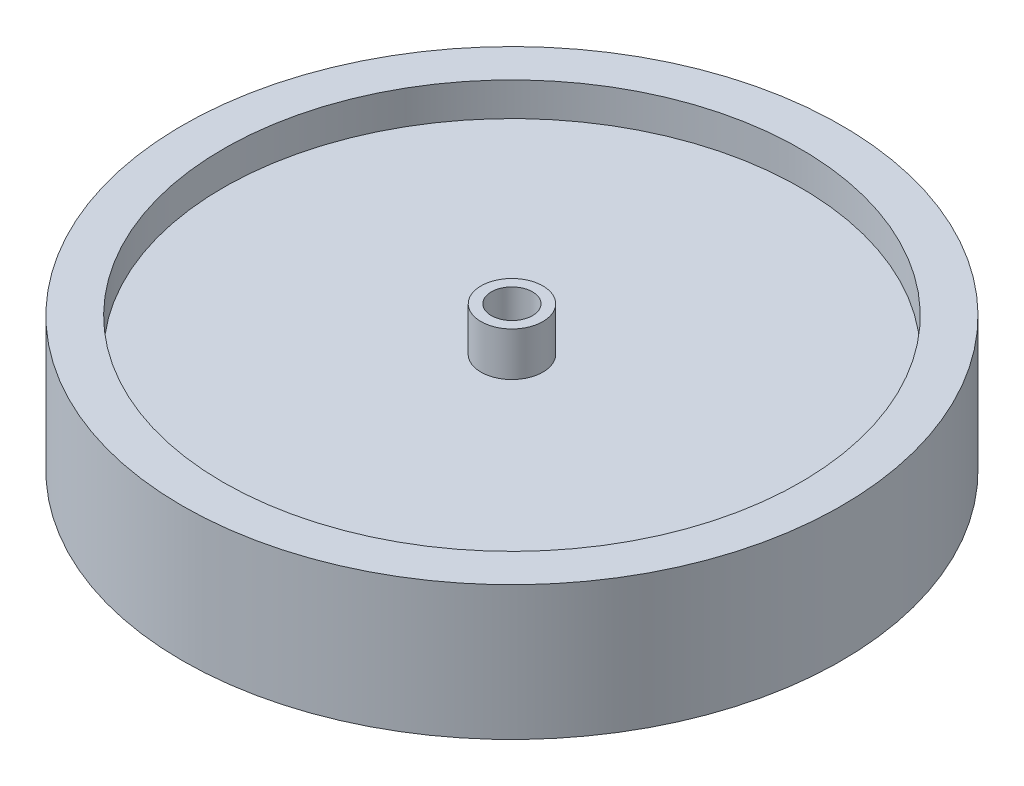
ISO-10303-21;
HEADER;
FILE_DESCRIPTION(('STEP AP214'),'2;1');
FILE_NAME('part.step','',(''),(''),'','','');
FILE_SCHEMA(('AUTOMOTIVE_DESIGN { 1 0 10303 214 1 1 1 1 }'));
ENDSEC;
DATA;
#1=APPLICATION_CONTEXT('core data for automotive mechanical design processes');
#2=APPLICATION_PROTOCOL_DEFINITION('international standard','automotive_design',2000,#1);
#3=PRODUCT_CONTEXT('',#1,'mechanical');
#4=PRODUCT('Part','Part','',(#3));
#5=PRODUCT_RELATED_PRODUCT_CATEGORY('part','',(#4));
#6=PRODUCT_DEFINITION_FORMATION('','',#4);
#7=PRODUCT_DEFINITION_CONTEXT('part definition',#1,'design');
#8=PRODUCT_DEFINITION('design','',#6,#7);
#9=PRODUCT_DEFINITION_SHAPE('','',#8);
#10=(LENGTH_UNIT() NAMED_UNIT(*) SI_UNIT(.MILLI.,.METRE.));
#11=(NAMED_UNIT(*) PLANE_ANGLE_UNIT() SI_UNIT($,.RADIAN.));
#12=(NAMED_UNIT(*) SI_UNIT($,.STERADIAN.) SOLID_ANGLE_UNIT());
#13=UNCERTAINTY_MEASURE_WITH_UNIT(LENGTH_MEASURE(1.E-05),#10,'distance_accuracy_value','');
#14=(GEOMETRIC_REPRESENTATION_CONTEXT(3) GLOBAL_UNCERTAINTY_ASSIGNED_CONTEXT((#13)) GLOBAL_UNIT_ASSIGNED_CONTEXT((#10,
#11,#12)) REPRESENTATION_CONTEXT('',''));
#15=CARTESIAN_POINT('',(0.,0.,0.));
#16=DIRECTION('',(0.,0.,1.));
#17=DIRECTION('',(1.,0.,0.));
#18=AXIS2_PLACEMENT_3D('',#15,#16,#17);
#19=CARTESIAN_POINT('',(4.76250000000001,-6.51115316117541,0.));
#20=DIRECTION('',(0.,-1.,0.));
#21=DIRECTION('',(0.,0.,-1.));
#22=AXIS2_PLACEMENT_3D('',#19,#20,#21);
#23=PLANE('',#22);
#24=CARTESIAN_POINT('',(0.,-6.51115316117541,0.));
#25=DIRECTION('',(0.,1.,0.));
#26=DIRECTION('',(0.,0.,1.));
#27=AXIS2_PLACEMENT_3D('',#24,#25,#26);
#28=CIRCLE('',#27,44.45);
#29=CARTESIAN_POINT('',(0.,-6.51115316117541,44.45));
#30=VERTEX_POINT('',#29);
#31=EDGE_CURVE('E51',#30,#30,#28,.T.);
#32=ORIENTED_EDGE('',*,*,#31,.F.);
#33=EDGE_LOOP('',(#32));
#34=FACE_BOUND('',#33,.T.);
#35=CARTESIAN_POINT('',(0.,-6.5111531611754,0.));
#36=DIRECTION('',(0.,1.,0.));
#37=DIRECTION('',(0.,0.,1.));
#38=AXIS2_PLACEMENT_3D('',#35,#36,#37);
#39=CIRCLE('',#38,50.7365);
#40=CARTESIAN_POINT('',(0.,-6.5111531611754,50.7365));
#41=VERTEX_POINT('',#40);
#42=EDGE_CURVE('E35',#41,#41,#39,.T.);
#43=ORIENTED_EDGE('',*,*,#42,.T.);
#44=EDGE_LOOP('',(#43));
#45=FACE_BOUND('',#44,.T.);
#46=ADVANCED_FACE('F28',(#34,#45),#23,.F.);
#47=CARTESIAN_POINT('',(0.,28.7361531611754,0.));
#48=DIRECTION('',(0.,1.,0.));
#49=DIRECTION('',(0.,0.,1.));
#50=AXIS2_PLACEMENT_3D('',#47,#48,#49);
#51=CYLINDRICAL_SURFACE('',#50,50.7365);
#52=ORIENTED_EDGE('',*,*,#42,.F.);
#53=EDGE_LOOP('',(#52));
#54=FACE_BOUND('',#53,.T.);
#55=CARTESIAN_POINT('',(0.,-27.1486531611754,0.));
#56=DIRECTION('',(0.,1.,0.));
#57=DIRECTION('',(0.,0.,1.));
#58=AXIS2_PLACEMENT_3D('',#55,#56,#57);
#59=CIRCLE('',#58,50.7365);
#60=CARTESIAN_POINT('',(0.,-27.1486531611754,50.7365));
#61=VERTEX_POINT('',#60);
#62=EDGE_CURVE('E39',#61,#61,#59,.T.);
#63=ORIENTED_EDGE('',*,*,#62,.T.);
#64=EDGE_LOOP('',(#63));
#65=FACE_BOUND('',#64,.T.);
#66=ADVANCED_FACE('F104',(#54,#65),#51,.T.);
#67=CARTESIAN_POINT('',(50.7365,-27.1486531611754,0.));
#68=DIRECTION('',(0.,1.,0.));
#69=DIRECTION('',(0.,0.,1.));
#70=AXIS2_PLACEMENT_3D('',#67,#68,#69);
#71=PLANE('',#70);
#72=CARTESIAN_POINT('',(0.,-27.1486531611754,0.));
#73=DIRECTION('',(0.,-1.,0.));
#74=DIRECTION('',(0.,0.,-1.));
#75=AXIS2_PLACEMENT_3D('',#72,#73,#74);
#76=CIRCLE('',#75,44.45);
#77=CARTESIAN_POINT('',(0.,-27.1486531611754,-44.45));
#78=VERTEX_POINT('',#77);
#79=EDGE_CURVE('E60',#78,#78,#76,.T.);
#80=ORIENTED_EDGE('',*,*,#79,.F.);
#81=EDGE_LOOP('',(#80));
#82=FACE_BOUND('',#81,.T.);
#83=ORIENTED_EDGE('',*,*,#62,.F.);
#84=EDGE_LOOP('',(#83));
#85=FACE_BOUND('',#84,.T.);
#86=ADVANCED_FACE('F100',(#82,#85),#71,.F.);
#87=CARTESIAN_POINT('',(0.,-11.6673531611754,0.));
#88=DIRECTION('',(0.,1.,0.));
#89=DIRECTION('',(0.,0.,1.));
#90=AXIS2_PLACEMENT_3D('',#87,#88,#89);
#91=CYLINDRICAL_SURFACE('',#90,44.45);
#92=CARTESIAN_POINT('',(0.,-11.6673531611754,0.));
#93=DIRECTION('',(0.,1.,0.));
#94=DIRECTION('',(0.,0.,1.));
#95=AXIS2_PLACEMENT_3D('',#92,#93,#94);
#96=CIRCLE('',#95,44.45);
#97=CARTESIAN_POINT('',(0.,-11.6673531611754,44.45));
#98=VERTEX_POINT('',#97);
#99=EDGE_CURVE('E48',#98,#98,#96,.T.);
#100=ORIENTED_EDGE('',*,*,#99,.F.);
#101=EDGE_LOOP('',(#100));
#102=FACE_BOUND('',#101,.T.);
#103=ORIENTED_EDGE('',*,*,#31,.T.);
#104=EDGE_LOOP('',(#103));
#105=FACE_BOUND('',#104,.T.);
#106=ADVANCED_FACE('F103',(#102,#105),#91,.F.);
#107=CARTESIAN_POINT('',(0.,-11.6673531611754,0.));
#108=DIRECTION('',(0.,1.,0.));
#109=DIRECTION('',(0.,0.,1.));
#110=AXIS2_PLACEMENT_3D('',#107,#108,#109);
#111=PLANE('',#110);
#112=CARTESIAN_POINT('',(0.,-11.6673531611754,0.));
#113=DIRECTION('',(0.,1.,0.));
#114=DIRECTION('',(0.,0.,1.));
#115=AXIS2_PLACEMENT_3D('',#112,#113,#114);
#116=CIRCLE('',#115,4.7625);
#117=CARTESIAN_POINT('',(0.,-11.6673531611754,4.7625));
#118=VERTEX_POINT('',#117);
#119=EDGE_CURVE('E54',#118,#118,#116,.T.);
#120=ORIENTED_EDGE('',*,*,#119,.F.);
#121=EDGE_LOOP('',(#120));
#122=FACE_BOUND('',#121,.T.);
#123=ORIENTED_EDGE('',*,*,#99,.T.);
#124=EDGE_LOOP('',(#123));
#125=FACE_BOUND('',#124,.T.);
#126=ADVANCED_FACE('F121',(#122,#125),#111,.T.);
#127=CARTESIAN_POINT('',(0.,-4.92365316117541,0.));
#128=DIRECTION('',(0.,-1.,0.));
#129=DIRECTION('',(0.,0.,-1.));
#130=AXIS2_PLACEMENT_3D('',#127,#128,#129);
#131=PLANE('',#130);
#132=CARTESIAN_POINT('',(0.,-4.92365316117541,0.));
#133=DIRECTION('',(0.,-1.,0.));
#134=DIRECTION('',(0.,0.,-1.));
#135=AXIS2_PLACEMENT_3D('',#132,#133,#134);
#136=CIRCLE('',#135,3.175);
#137=CARTESIAN_POINT('',(0.,-4.92365316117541,-3.175));
#138=VERTEX_POINT('',#137);
#139=EDGE_CURVE('E66',#138,#138,#136,.T.);
#140=ORIENTED_EDGE('',*,*,#139,.T.);
#141=EDGE_LOOP('',(#140));
#142=FACE_BOUND('',#141,.T.);
#143=CARTESIAN_POINT('',(0.,-4.92365316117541,0.));
#144=DIRECTION('',(0.,1.,0.));
#145=DIRECTION('',(0.,0.,1.));
#146=AXIS2_PLACEMENT_3D('',#143,#144,#145);
#147=CIRCLE('',#146,4.7625);
#148=CARTESIAN_POINT('',(0.,-4.92365316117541,4.7625));
#149=VERTEX_POINT('',#148);
#150=EDGE_CURVE('E10',#149,#149,#147,.T.);
#151=ORIENTED_EDGE('',*,*,#150,.T.);
#152=EDGE_LOOP('',(#151));
#153=FACE_BOUND('',#152,.T.);
#154=ADVANCED_FACE('F30',(#142,#153),#131,.F.);
#155=CARTESIAN_POINT('',(0.,28.7361531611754,0.));
#156=DIRECTION('',(0.,1.,0.));
#157=DIRECTION('',(0.,0.,1.));
#158=AXIS2_PLACEMENT_3D('',#155,#156,#157);
#159=CYLINDRICAL_SURFACE('',#158,4.7625);
#160=ORIENTED_EDGE('',*,*,#150,.F.);
#161=EDGE_LOOP('',(#160));
#162=FACE_BOUND('',#161,.T.);
#163=ORIENTED_EDGE('',*,*,#119,.T.);
#164=EDGE_LOOP('',(#163));
#165=FACE_BOUND('',#164,.T.);
#166=ADVANCED_FACE('F96',(#162,#165),#159,.T.);
#167=CARTESIAN_POINT('',(0.,-21.9924531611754,0.));
#168=DIRECTION('',(0.,-1.,0.));
#169=DIRECTION('',(0.,0.,-1.));
#170=AXIS2_PLACEMENT_3D('',#167,#168,#169);
#171=CYLINDRICAL_SURFACE('',#170,44.45);
#172=CARTESIAN_POINT('',(0.,-21.9924531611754,0.));
#173=DIRECTION('',(0.,-1.,0.));
#174=DIRECTION('',(0.,0.,-1.));
#175=AXIS2_PLACEMENT_3D('',#172,#173,#174);
#176=CIRCLE('',#175,44.45);
#177=CARTESIAN_POINT('',(0.,-21.9924531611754,-44.45));
#178=VERTEX_POINT('',#177);
#179=EDGE_CURVE('E57',#178,#178,#176,.T.);
#180=ORIENTED_EDGE('',*,*,#179,.F.);
#181=EDGE_LOOP('',(#180));
#182=FACE_BOUND('',#181,.T.);
#183=ORIENTED_EDGE('',*,*,#79,.T.);
#184=EDGE_LOOP('',(#183));
#185=FACE_BOUND('',#184,.T.);
#186=ADVANCED_FACE('F90',(#182,#185),#171,.F.);
#187=CARTESIAN_POINT('',(0.,-21.9924531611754,0.));
#188=DIRECTION('',(0.,-1.,0.));
#189=DIRECTION('',(0.,0.,-1.));
#190=AXIS2_PLACEMENT_3D('',#187,#188,#189);
#191=PLANE('',#190);
#192=CARTESIAN_POINT('',(0.,-21.9924531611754,0.));
#193=DIRECTION('',(0.,-1.,0.));
#194=DIRECTION('',(0.,0.,-1.));
#195=AXIS2_PLACEMENT_3D('',#192,#193,#194);
#196=CIRCLE('',#195,4.7625);
#197=CARTESIAN_POINT('',(0.,-21.9924531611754,-4.7625));
#198=VERTEX_POINT('',#197);
#199=EDGE_CURVE('E63',#198,#198,#196,.T.);
#200=ORIENTED_EDGE('',*,*,#199,.F.);
#201=EDGE_LOOP('',(#200));
#202=FACE_BOUND('',#201,.T.);
#203=ORIENTED_EDGE('',*,*,#179,.T.);
#204=EDGE_LOOP('',(#203));
#205=FACE_BOUND('',#204,.T.);
#206=ADVANCED_FACE('F79',(#202,#205),#191,.T.);
#207=CARTESIAN_POINT('',(4.76250000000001,-28.7361531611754,0.));
#208=DIRECTION('',(0.,1.,0.));
#209=DIRECTION('',(0.,0.,1.));
#210=AXIS2_PLACEMENT_3D('',#207,#208,#209);
#211=PLANE('',#210);
#212=CARTESIAN_POINT('',(0.,-28.7361531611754,0.));
#213=DIRECTION('',(0.,-1.,0.));
#214=DIRECTION('',(0.,0.,-1.));
#215=AXIS2_PLACEMENT_3D('',#212,#213,#214);
#216=CIRCLE('',#215,3.175);
#217=CARTESIAN_POINT('',(0.,-28.7361531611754,-3.175));
#218=VERTEX_POINT('',#217);
#219=EDGE_CURVE('E69',#218,#218,#216,.T.);
#220=ORIENTED_EDGE('',*,*,#219,.F.);
#221=EDGE_LOOP('',(#220));
#222=FACE_BOUND('',#221,.T.);
#223=CARTESIAN_POINT('',(0.,-28.7361531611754,0.));
#224=DIRECTION('',(0.,1.,0.));
#225=DIRECTION('',(0.,0.,1.));
#226=AXIS2_PLACEMENT_3D('',#223,#224,#225);
#227=CIRCLE('',#226,4.76250000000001);
#228=CARTESIAN_POINT('',(0.,-28.7361531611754,4.76250000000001));
#229=VERTEX_POINT('',#228);
#230=EDGE_CURVE('E43',#229,#229,#227,.T.);
#231=ORIENTED_EDGE('',*,*,#230,.F.);
#232=EDGE_LOOP('',(#231));
#233=FACE_BOUND('',#232,.T.);
#234=ADVANCED_FACE('F75',(#222,#233),#211,.F.);
#235=CARTESIAN_POINT('',(0.,28.7361531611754,0.));
#236=DIRECTION('',(0.,1.,0.));
#237=DIRECTION('',(0.,0.,1.));
#238=AXIS2_PLACEMENT_3D('',#235,#236,#237);
#239=CYLINDRICAL_SURFACE('',#238,4.76250000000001);
#240=ORIENTED_EDGE('',*,*,#230,.T.);
#241=EDGE_LOOP('',(#240));
#242=FACE_BOUND('',#241,.T.);
#243=ORIENTED_EDGE('',*,*,#199,.T.);
#244=EDGE_LOOP('',(#243));
#245=FACE_BOUND('',#244,.T.);
#246=ADVANCED_FACE('F78',(#242,#245),#239,.T.);
#247=CARTESIAN_POINT('',(0.,-4.92365316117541,0.));
#248=DIRECTION('',(0.,-1.,0.));
#249=DIRECTION('',(0.,0.,-1.));
#250=AXIS2_PLACEMENT_3D('',#247,#248,#249);
#251=CYLINDRICAL_SURFACE('',#250,3.175);
#252=ORIENTED_EDGE('',*,*,#139,.F.);
#253=EDGE_LOOP('',(#252));
#254=FACE_BOUND('',#253,.T.);
#255=ORIENTED_EDGE('',*,*,#219,.T.);
#256=EDGE_LOOP('',(#255));
#257=FACE_BOUND('',#256,.T.);
#258=ADVANCED_FACE('F73',(#254,#257),#251,.F.);
#259=CLOSED_SHELL('',(#46,#66,#86,#106,#126,#154,#166,#186,#206,#234,#246,#258));
#260=MANIFOLD_SOLID_BREP('B2',#259);
#261=ADVANCED_BREP_SHAPE_REPRESENTATION('',(#18,#260),#14);
#262=SHAPE_DEFINITION_REPRESENTATION(#9,#261);
ENDSEC;
END-ISO-10303-21;
